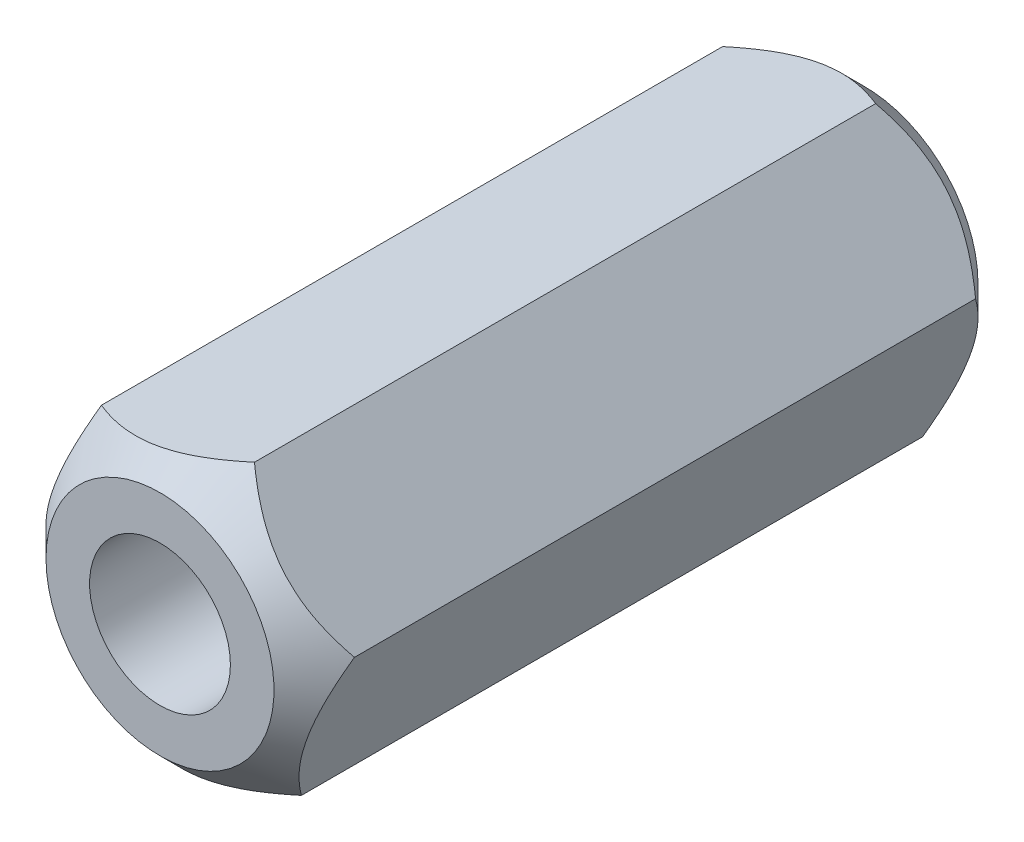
ISO-10303-21;
HEADER;
FILE_DESCRIPTION(('STEP AP214'),'2;1');
FILE_NAME('part.step','',(''),(''),'','','');
FILE_SCHEMA(('AUTOMOTIVE_DESIGN { 1 0 10303 214 1 1 1 1 }'));
ENDSEC;
DATA;
#1=APPLICATION_CONTEXT('core data for automotive mechanical design processes');
#2=APPLICATION_PROTOCOL_DEFINITION('international standard','automotive_design',2000,#1);
#3=PRODUCT_CONTEXT('',#1,'mechanical');
#4=PRODUCT('Part','Part','',(#3));
#5=PRODUCT_RELATED_PRODUCT_CATEGORY('part','',(#4));
#6=PRODUCT_DEFINITION_FORMATION('','',#4);
#7=PRODUCT_DEFINITION_CONTEXT('part definition',#1,'design');
#8=PRODUCT_DEFINITION('design','',#6,#7);
#9=PRODUCT_DEFINITION_SHAPE('','',#8);
#10=(LENGTH_UNIT() NAMED_UNIT(*) SI_UNIT(.MILLI.,.METRE.));
#11=(NAMED_UNIT(*) PLANE_ANGLE_UNIT() SI_UNIT($,.RADIAN.));
#12=(NAMED_UNIT(*) SI_UNIT($,.STERADIAN.) SOLID_ANGLE_UNIT());
#13=UNCERTAINTY_MEASURE_WITH_UNIT(LENGTH_MEASURE(1.E-05),#10,'distance_accuracy_value','');
#14=(GEOMETRIC_REPRESENTATION_CONTEXT(3) GLOBAL_UNCERTAINTY_ASSIGNED_CONTEXT((#13)) GLOBAL_UNIT_ASSIGNED_CONTEXT((#10,
#11,#12)) REPRESENTATION_CONTEXT('',''));
#15=CARTESIAN_POINT('',(0.,0.,0.));
#16=DIRECTION('',(0.,0.,1.));
#17=DIRECTION('',(1.,0.,0.));
#18=AXIS2_PLACEMENT_3D('',#15,#16,#17);
#19=CARTESIAN_POINT('',(23.598367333,209.806088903,-17.));
#20=DIRECTION('',(0.,0.,-1.));
#21=DIRECTION('',(-0.984657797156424,-0.174496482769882,0.));
#22=AXIS2_PLACEMENT_3D('',#19,#20,#21);
#23=PLANE('',#22);
#24=CARTESIAN_POINT('',(17.14,214.32,-16.9999999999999));
#25=DIRECTION('',(0.,0.,1.));
#26=DIRECTION('',(1.,0.,0.));
#27=AXIS2_PLACEMENT_3D('',#24,#25,#26);
#28=CIRCLE('',#27,5.50555349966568);
#29=CARTESIAN_POINT('',(22.6455534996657,214.32,-16.9999999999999));
#30=VERTEX_POINT('',#29);
#31=EDGE_CURVE('E45',#30,#30,#28,.F.);
#32=ORIENTED_EDGE('',*,*,#31,.T.);
#33=EDGE_LOOP('',(#32));
#34=FACE_BOUND('',#33,.T.);
#35=CARTESIAN_POINT('',(17.14,214.32,-16.9999999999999));
#36=DIRECTION('',(0.,0.,1.));
#37=DIRECTION('',(1.,0.,0.));
#38=AXIS2_PLACEMENT_3D('',#35,#36,#37);
#39=CIRCLE('',#38,3.39999999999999);
#40=CARTESIAN_POINT('',(20.54,214.32,-16.9999999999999));
#41=VERTEX_POINT('',#40);
#42=EDGE_CURVE('E251',#41,#41,#39,.T.);
#43=ORIENTED_EDGE('',*,*,#42,.T.);
#44=EDGE_LOOP('',(#43));
#45=FACE_BOUND('',#44,.T.);
#46=ADVANCED_FACE('F41',(#34,#45),#23,.T.);
#47=CARTESIAN_POINT('',(17.14,214.32,-17.));
#48=DIRECTION('',(0.,0.,1.));
#49=DIRECTION('',(1.,0.,0.));
#50=AXIS2_PLACEMENT_3D('',#47,#48,#49);
#51=CONICAL_SURFACE('',#50,5.50555349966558,0.785398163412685);
#52=CARTESIAN_POINT('',(19.7009737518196,221.375122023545,-15.0000000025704));
#53=CARTESIAN_POINT('',(19.7840077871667,221.276338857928,-15.0645131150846));
#54=CARTESIAN_POINT('',(19.8676800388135,221.176796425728,-15.1270462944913));
#55=CARTESIAN_POINT('',(20.0364261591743,220.976044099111,-15.2475505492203));
#56=CARTESIAN_POINT('',(20.1215007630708,220.87483333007,-15.3055191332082));
#57=CARTESIAN_POINT('',(20.3798060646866,220.567535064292,-15.4721688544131));
#58=CARTESIAN_POINT('',(20.5552232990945,220.358846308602,-15.5728831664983));
#59=CARTESIAN_POINT('',(20.9089660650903,219.938008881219,-15.7453489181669));
#60=CARTESIAN_POINT('',(21.0872012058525,219.725967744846,-15.8175348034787));
#61=CARTESIAN_POINT('',(21.3574838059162,219.404420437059,-15.9010357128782));
#62=CARTESIAN_POINT('',(21.4479758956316,219.296764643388,-15.9247285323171));
#63=CARTESIAN_POINT('',(21.6297261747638,219.080541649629,-15.9633187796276));
#64=CARTESIAN_POINT('',(21.7209842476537,218.971974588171,-15.9782175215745));
#65=CARTESIAN_POINT('',(21.943375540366,218.707402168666,-16.0031980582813));
#66=CARTESIAN_POINT('',(22.0747483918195,218.551111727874,-16.008438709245));
#67=CARTESIAN_POINT('',(22.3372572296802,218.23881263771,-15.9996376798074));
#68=CARTESIAN_POINT('',(22.4683931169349,218.082804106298,-15.9855892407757));
#69=CARTESIAN_POINT('',(22.729428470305,217.772257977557,-15.9390381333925));
#70=CARTESIAN_POINT('',(22.85932638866,217.617722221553,-15.9065148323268));
#71=CARTESIAN_POINT('',(23.116889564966,217.311306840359,-15.8247821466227));
#72=CARTESIAN_POINT('',(23.2445549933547,217.159427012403,-15.7755740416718));
#73=CARTESIAN_POINT('',(23.4711684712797,216.889831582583,-15.6743452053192));
#74=CARTESIAN_POINT('',(23.5706186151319,216.771518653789,-15.6249882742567));
#75=CARTESIAN_POINT('',(23.7677339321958,216.537016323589,-15.5183218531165));
#76=CARTESIAN_POINT('',(23.8653990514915,216.420826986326,-15.4610121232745));
#77=CARTESIAN_POINT('',(24.0586366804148,216.190937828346,-15.339724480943));
#78=CARTESIAN_POINT('',(24.1542146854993,216.077231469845,-15.275767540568));
#79=CARTESIAN_POINT('',(24.3436011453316,215.851923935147,-15.1420248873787));
#80=CARTESIAN_POINT('',(24.4374106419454,215.740321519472,-15.0722427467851));
#81=CARTESIAN_POINT('',(24.5304017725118,215.62969268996,-15.0000000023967));
#82=B_SPLINE_CURVE_WITH_KNOTS('',3,(#52,#53,#54,#55,#56,#57,#58,#59,#60,#61,#62,#63,#64,#65,#66,
#67,#68,#69,#70,#71,#72,#73,#74,#75,#76,#77,#78,#79,#80,#81),.UNSPECIFIED.,.F.,.F.,(4,2,2,2,2,2,
2,2,2,2,2,2,2,2,4),(0.,0.432793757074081,0.86582211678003,1.73655298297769,2.59345958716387,
3.02107268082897,3.44862186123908,4.0603826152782,4.67235777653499,5.28501773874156,
5.89763072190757,6.38414619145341,6.87067633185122,7.35571555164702,7.84045948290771),.UNSPECIFIED.);
#83=CARTESIAN_POINT('',(19.7009737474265,221.375122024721,-15.0000000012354));
#84=VERTEX_POINT('',#83);
#85=CARTESIAN_POINT('',(24.5304017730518,215.629692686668,-15.0000000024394));
#86=VERTEX_POINT('',#85);
#87=EDGE_CURVE('E88',#84,#86,#82,.T.);
#88=ORIENTED_EDGE('',*,*,#87,.T.);
#89=CARTESIAN_POINT('',(24.5304017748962,215.629692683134,-15.0000000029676));
#90=CARTESIAN_POINT('',(24.4863700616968,215.508391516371,-15.0645131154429));
#91=CARTESIAN_POINT('',(24.4419999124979,215.386158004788,-15.1270462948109));
#92=CARTESIAN_POINT('',(24.3525163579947,215.139643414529,-15.2475505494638));
#93=CARTESIAN_POINT('',(24.3074025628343,215.015361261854,-15.3055191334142));
#94=CARTESIAN_POINT('',(24.1704271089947,214.638013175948,-15.4721688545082));
#95=CARTESIAN_POINT('',(24.0774059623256,214.381753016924,-15.5728831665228));
#96=CARTESIAN_POINT('',(23.8898214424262,213.864984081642,-15.7453489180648));
#97=CARTESIAN_POINT('',(23.7953060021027,213.604607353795,-15.8175348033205));
#98=CARTESIAN_POINT('',(23.6519791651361,213.209762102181,-15.9010357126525));
#99=CARTESIAN_POINT('',(23.6039925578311,213.077565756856,-15.9247285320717));
#100=CARTESIAN_POINT('',(23.5076130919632,212.812053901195,-15.9633187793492));
#101=CARTESIAN_POINT('',(23.4592202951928,212.67873856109,-15.9782175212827));
#102=CARTESIAN_POINT('',(23.341289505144,212.353855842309,-16.0031980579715));
#103=CARTESIAN_POINT('',(23.2716244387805,212.16193839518,-16.0084387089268));
#104=CARTESIAN_POINT('',(23.1324199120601,211.77844952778,-15.9996376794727));
#105=CARTESIAN_POINT('',(23.0628805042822,211.586878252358,-15.9855892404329));
#106=CARTESIAN_POINT('',(22.9244573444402,211.20554194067,-15.9390381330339));
#107=CARTESIAN_POINT('',(22.8555744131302,211.015779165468,-15.9065148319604));
#108=CARTESIAN_POINT('',(22.7189924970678,210.639515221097,-15.8247821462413));
#109=CARTESIAN_POINT('',(22.6512934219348,210.453013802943,-15.7755740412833));
#110=CARTESIAN_POINT('',(22.5311236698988,210.121963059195,-15.6743452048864));
#111=CARTESIAN_POINT('',(22.4783867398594,209.976680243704,-15.6249882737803));
#112=CARTESIAN_POINT('',(22.3738594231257,209.68872220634,-15.5183218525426));
#113=CARTESIAN_POINT('',(22.3220690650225,209.546047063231,-15.4610121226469));
#114=CARTESIAN_POINT('',(22.2195980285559,209.263753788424,-15.3397244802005));
#115=CARTESIAN_POINT('',(22.1689144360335,209.124127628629,-15.2757675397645));
#116=CARTESIAN_POINT('',(22.0684856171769,208.847460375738,-15.1420248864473));
#117=CARTESIAN_POINT('',(22.0187398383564,208.710417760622,-15.0722427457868));
#118=CARTESIAN_POINT('',(21.9694280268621,208.574570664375,-15.0000000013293));
#119=B_SPLINE_CURVE_WITH_KNOTS('',3,(#89,#90,#91,#92,#93,#94,#95,#96,#97,#98,#99,#100,#101,#102,
#103,#104,#105,#106,#107,#108,#109,#110,#111,#112,#113,#114,#115,#116,#117,#118),.UNSPECIFIED.,
.F.,.F.,(4,2,2,2,2,2,2,2,2,2,2,2,2,2,4),(0.,0.432793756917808,0.865822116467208,
1.73655298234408,2.59345958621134,3.02107267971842,3.44862185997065,4.06038261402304,
4.67235777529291,5.28501773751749,5.89763072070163,6.38414619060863,6.87067633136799,
7.35571555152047,7.84045948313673),.UNSPECIFIED.);
#120=CARTESIAN_POINT('',(21.9694280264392,208.57457066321,-15.0000000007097));
#121=VERTEX_POINT('',#120);
#122=EDGE_CURVE('E91',#86,#121,#119,.T.);
#123=ORIENTED_EDGE('',*,*,#122,.T.);
#124=CARTESIAN_POINT('',(21.9694280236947,208.574570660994,-15.0000000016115));
#125=CARTESIAN_POINT('',(21.8423622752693,208.552052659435,-15.064513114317));
#126=CARTESIAN_POINT('',(21.7143198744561,208.529361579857,-15.1270462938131));
#127=CARTESIAN_POINT('',(21.4560901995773,208.483599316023,-15.2475505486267));
#128=CARTESIAN_POINT('',(21.3259018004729,208.460527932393,-15.3055191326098));
#129=CARTESIAN_POINT('',(20.9306210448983,208.390478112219,-15.4721688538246));
#130=CARTESIAN_POINT('',(20.6621826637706,208.342906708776,-15.5728831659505));
#131=CARTESIAN_POINT('',(20.1208553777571,208.246975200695,-15.7453489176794));
#132=CARTESIAN_POINT('',(19.8481047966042,208.198639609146,-15.8175348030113));
#133=CARTESIAN_POINT('',(19.4344953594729,208.125341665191,-15.9010357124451));
#134=CARTESIAN_POINT('',(19.2960166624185,208.100801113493,-15.924728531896));
#135=CARTESIAN_POINT('',(19.0178869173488,208.051512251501,-15.9633187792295));
#136=CARTESIAN_POINT('',(18.8782360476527,208.026763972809,-15.9782175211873));
#137=CARTESIAN_POINT('',(18.5379139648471,207.966453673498,-16.0031980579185));
#138=CARTESIAN_POINT('',(18.336876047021,207.930826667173,-16.0084387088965));
#139=CARTESIAN_POINT('',(17.9351626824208,207.859636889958,-15.9996376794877));
#140=CARTESIAN_POINT('',(17.7344873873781,207.824074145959,-15.9855892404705));
#141=CARTESIAN_POINT('',(17.3350288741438,207.753283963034,-15.9390381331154));
#142=CARTESIAN_POINT('',(17.1362480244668,207.718056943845,-15.9065148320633));
#143=CARTESIAN_POINT('',(16.7421029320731,207.64820838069,-15.8247821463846));
#144=CARTESIAN_POINT('',(16.5467384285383,207.613586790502,-15.7755740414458));
#145=CARTESIAN_POINT('',(16.1999551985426,207.552131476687,-15.6743452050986));
#146=CARTESIAN_POINT('',(16.0477681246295,207.525161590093,-15.6249882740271));
#147=CARTESIAN_POINT('',(15.7461254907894,207.471705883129,-15.518321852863));
#148=CARTESIAN_POINT('',(15.5966700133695,207.445220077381,-15.4610121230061));
#149=CARTESIAN_POINT('',(15.3009613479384,207.392815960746,-15.3397244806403));
#150=CARTESIAN_POINT('',(15.1546997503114,207.366896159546,-15.275767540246));
#151=CARTESIAN_POINT('',(14.8648844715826,207.315536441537,-15.1420248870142));
#152=CARTESIAN_POINT('',(14.7213291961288,207.290096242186,-15.0722427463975));
#153=CARTESIAN_POINT('',(14.5790262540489,207.26487797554,-15.0000000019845));
#154=B_SPLINE_CURVE_WITH_KNOTS('',3,(#124,#125,#126,#127,#128,#129,#130,#131,#132,#133,#134,
#135,#136,#137,#138,#139,#140,#141,#142,#143,#144,#145,#146,#147,#148,#149,#150,#151,#152,#153),
.UNSPECIFIED.,.F.,.F.,(4,2,2,2,2,2,2,2,2,2,2,2,2,2,4),(0.,0.432793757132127,0.865822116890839,
1.73655298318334,2.59345958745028,3.02107268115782,3.4486218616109,4.06038261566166,
4.67235777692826,5.28501773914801,5.89763072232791,6.38414619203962,6.87067633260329,
7.35571555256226,7.84045948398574),.UNSPECIFIED.);
#155=CARTESIAN_POINT('',(14.5790262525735,207.264877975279,-15.0000000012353));
#156=VERTEX_POINT('',#155);
#157=EDGE_CURVE('E176',#121,#156,#154,.T.);
#158=ORIENTED_EDGE('',*,*,#157,.T.);
#159=CARTESIAN_POINT('',(14.5790262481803,207.264877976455,-15.0000000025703));
#160=CARTESIAN_POINT('',(14.4959922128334,207.363661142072,-15.0645131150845));
#161=CARTESIAN_POINT('',(14.4123199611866,207.463203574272,-15.1270462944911));
#162=CARTESIAN_POINT('',(14.2435738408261,207.663955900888,-15.2475505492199));
#163=CARTESIAN_POINT('',(14.1584992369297,207.76516666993,-15.3055191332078));
#164=CARTESIAN_POINT('',(13.9001939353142,208.072464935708,-15.4721688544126));
#165=CARTESIAN_POINT('',(13.7247767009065,208.281153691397,-15.5728831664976));
#166=CARTESIAN_POINT('',(13.3710339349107,208.70199111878,-15.7453489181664));
#167=CARTESIAN_POINT('',(13.1927987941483,208.914032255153,-15.8175348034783));
#168=CARTESIAN_POINT('',(12.9225161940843,209.23557956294,-15.9010357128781));
#169=CARTESIAN_POINT('',(12.8320241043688,209.343235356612,-15.924728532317));
#170=CARTESIAN_POINT('',(12.6502738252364,209.559458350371,-15.9633187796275));
#171=CARTESIAN_POINT('',(12.5590157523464,209.668025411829,-15.9782175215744));
#172=CARTESIAN_POINT('',(12.3366244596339,209.932597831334,-16.0031980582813));
#173=CARTESIAN_POINT('',(12.2052516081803,210.088888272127,-16.0084387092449));
#174=CARTESIAN_POINT('',(11.9427427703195,210.40118736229,-15.9996376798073));
#175=CARTESIAN_POINT('',(11.8116068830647,210.557195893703,-15.9855892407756));
#176=CARTESIAN_POINT('',(11.5505715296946,210.867742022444,-15.9390381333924));
#177=CARTESIAN_POINT('',(11.4206736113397,211.022277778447,-15.9065148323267));
#178=CARTESIAN_POINT('',(11.1631104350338,211.328693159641,-15.8247821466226));
#179=CARTESIAN_POINT('',(11.0354450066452,211.480572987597,-15.7755740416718));
#180=CARTESIAN_POINT('',(10.8088315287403,211.750168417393,-15.674345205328));
#181=CARTESIAN_POINT('',(10.7093813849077,211.868481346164,-15.6249882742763));
#182=CARTESIAN_POINT('',(10.5122660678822,212.102983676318,-15.5183218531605));
#183=CARTESIAN_POINT('',(10.4146009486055,212.219173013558,-15.4610121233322));
#184=CARTESIAN_POINT('',(10.2213633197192,212.449062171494,-15.3397244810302));
#185=CARTESIAN_POINT('',(10.1257853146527,212.562768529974,-15.2757675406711));
#186=CARTESIAN_POINT('',(9.93639885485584,212.78807606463,-15.1420248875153));
#187=CARTESIAN_POINT('',(9.84258935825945,212.899678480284,-15.0722427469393));
#188=CARTESIAN_POINT('',(9.74959822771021,213.010307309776,-15.0000000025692));
#189=B_SPLINE_CURVE_WITH_KNOTS('',3,(#159,#160,#161,#162,#163,#164,#165,#166,#167,#168,#169,
#170,#171,#172,#173,#174,#175,#176,#177,#178,#179,#180,#181,#182,#183,#184,#185,#186,#187,#188),
.UNSPECIFIED.,.F.,.F.,(4,2,2,2,2,2,2,2,2,2,2,2,2,2,4),(0.,0.432793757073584,0.86582211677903,
1.73655298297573,2.59345958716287,3.02107268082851,3.44862186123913,4.06038261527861,
4.67235777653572,5.28501773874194,5.89763072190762,6.3841461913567,6.87067633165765,
7.35571555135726,7.84045948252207),.UNSPECIFIED.);
#190=CARTESIAN_POINT('',(9.74959822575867,213.010307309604,-15.0000000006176));
#191=VERTEX_POINT('',#190);
#192=EDGE_CURVE('E183',#156,#191,#189,.T.);
#193=ORIENTED_EDGE('',*,*,#192,.T.);
#194=CARTESIAN_POINT('',(9.74959822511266,213.010307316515,-15.0000000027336));
#195=CARTESIAN_POINT('',(9.79362993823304,213.131608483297,-15.0645131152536));
#196=CARTESIAN_POINT('',(9.83800008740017,213.253841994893,-15.1270462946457));
#197=CARTESIAN_POINT('',(9.92748364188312,213.500356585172,-15.2475505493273));
#198=CARTESIAN_POINT('',(9.97259743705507,213.624638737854,-15.3055191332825));
#199=CARTESIAN_POINT('',(10.1095728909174,214.001986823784,-15.4721688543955));
#200=CARTESIAN_POINT('',(10.2025940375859,214.258246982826,-15.5728831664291));
#201=CARTESIAN_POINT('',(10.390178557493,214.775015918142,-15.7453489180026));
#202=CARTESIAN_POINT('',(10.4846939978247,215.035392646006,-15.8175348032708));
#203=CARTESIAN_POINT('',(10.6280208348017,215.430237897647,-15.90103571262));
#204=CARTESIAN_POINT('',(10.6760074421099,215.562434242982,-15.9247285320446));
#205=CARTESIAN_POINT('',(10.7723869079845,215.827946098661,-15.9633187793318));
#206=CARTESIAN_POINT('',(10.8207797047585,215.961261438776,-15.9782175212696));
#207=CARTESIAN_POINT('',(10.9387104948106,216.286144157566,-16.003198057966));
#208=CARTESIAN_POINT('',(11.0083755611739,216.478061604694,-16.0084387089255));
#209=CARTESIAN_POINT('',(11.1475800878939,216.861550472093,-15.9996376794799));
#210=CARTESIAN_POINT('',(11.2171194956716,217.053121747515,-15.9855892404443));
#211=CARTESIAN_POINT('',(11.3555426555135,217.434458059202,-15.9390381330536));
#212=CARTESIAN_POINT('',(11.4244255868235,217.624220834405,-15.9065148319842));
#213=CARTESIAN_POINT('',(11.5610075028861,218.000484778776,-15.8247821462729));
#214=CARTESIAN_POINT('',(11.6287065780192,218.18698619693,-15.7755740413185));
#215=CARTESIAN_POINT('',(11.7488763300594,218.51803694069,-15.6743452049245));
#216=CARTESIAN_POINT('',(11.8016132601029,218.663319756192,-15.6249882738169));
#217=CARTESIAN_POINT('',(11.9061405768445,218.951277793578,-15.518321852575));
#218=CARTESIAN_POINT('',(11.9579309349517,219.093952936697,-15.4610121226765));
#219=CARTESIAN_POINT('',(12.0604019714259,219.376246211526,-15.3397244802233));
#220=CARTESIAN_POINT('',(12.111085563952,219.515872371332,-15.2757675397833));
#221=CARTESIAN_POINT('',(12.211514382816,219.792539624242,-15.1420248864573));
#222=CARTESIAN_POINT('',(12.2612601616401,219.929582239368,-15.0722427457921));
#223=CARTESIAN_POINT('',(12.3105719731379,220.065429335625,-15.0000000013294));
#224=B_SPLINE_CURVE_WITH_KNOTS('',3,(#194,#195,#196,#197,#198,#199,#200,#201,#202,#203,#204,
#205,#206,#207,#208,#209,#210,#211,#212,#213,#214,#215,#216,#217,#218,#219,#220,#221,#222,#223),
.UNSPECIFIED.,.F.,.F.,(4,2,2,2,2,2,2,2,2,2,2,2,2,2,4),(0.,0.432793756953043,0.865822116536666,
1.73655298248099,2.59345958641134,3.02107267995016,3.44862186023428,4.06038261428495,
4.67235777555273,5.28501773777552,5.89763072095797,6.38414619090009,6.87067633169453,
7.35571555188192,7.84045948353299),.UNSPECIFIED.);
#225=CARTESIAN_POINT('',(12.3105719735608,220.06542933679,-15.0000000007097));
#226=VERTEX_POINT('',#225);
#227=EDGE_CURVE('E193',#191,#226,#224,.T.);
#228=ORIENTED_EDGE('',*,*,#227,.T.);
#229=CARTESIAN_POINT('',(12.3105719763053,220.065429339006,-15.0000000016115));
#230=CARTESIAN_POINT('',(12.4376377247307,220.087947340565,-15.0645131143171));
#231=CARTESIAN_POINT('',(12.5656801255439,220.110638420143,-15.1270462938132));
#232=CARTESIAN_POINT('',(12.8239098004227,220.156400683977,-15.2475505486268));
#233=CARTESIAN_POINT('',(12.954098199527,220.179472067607,-15.3055191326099));
#234=CARTESIAN_POINT('',(13.3493789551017,220.249521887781,-15.4721688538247));
#235=CARTESIAN_POINT('',(13.6178173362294,220.297093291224,-15.5728831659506));
#236=CARTESIAN_POINT('',(14.1591446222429,220.393024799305,-15.7453489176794));
#237=CARTESIAN_POINT('',(14.4318952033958,220.441360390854,-15.8175348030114));
#238=CARTESIAN_POINT('',(14.8455046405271,220.514658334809,-15.9010357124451));
#239=CARTESIAN_POINT('',(14.9839833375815,220.539198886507,-15.9247285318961));
#240=CARTESIAN_POINT('',(15.2621130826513,220.588487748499,-15.9633187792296));
#241=CARTESIAN_POINT('',(15.4017639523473,220.613236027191,-15.9782175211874));
#242=CARTESIAN_POINT('',(15.742086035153,220.673546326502,-16.0031980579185));
#243=CARTESIAN_POINT('',(15.943123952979,220.709173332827,-16.0084387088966));
#244=CARTESIAN_POINT('',(16.3448373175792,220.780363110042,-15.9996376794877));
#245=CARTESIAN_POINT('',(16.5455126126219,220.815925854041,-15.9855892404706));
#246=CARTESIAN_POINT('',(16.9449711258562,220.886716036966,-15.9390381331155));
#247=CARTESIAN_POINT('',(17.1437519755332,220.921943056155,-15.9065148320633));
#248=CARTESIAN_POINT('',(17.5378970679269,220.99179161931,-15.8247821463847));
#249=CARTESIAN_POINT('',(17.7332615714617,221.026413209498,-15.7755740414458));
#250=CARTESIAN_POINT('',(18.0800448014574,221.087868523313,-15.6743452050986));
#251=CARTESIAN_POINT('',(18.2322318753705,221.114838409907,-15.6249882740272));
#252=CARTESIAN_POINT('',(18.5338745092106,221.168294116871,-15.518321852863));
#253=CARTESIAN_POINT('',(18.6833299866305,221.194779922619,-15.4610121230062));
#254=CARTESIAN_POINT('',(18.9790386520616,221.247184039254,-15.3397244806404));
#255=CARTESIAN_POINT('',(19.1253002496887,221.273103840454,-15.275767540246));
#256=CARTESIAN_POINT('',(19.4151155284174,221.324463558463,-15.1420248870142));
#257=CARTESIAN_POINT('',(19.5586708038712,221.349903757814,-15.0722427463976));
#258=CARTESIAN_POINT('',(19.7009737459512,221.37512202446,-15.0000000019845));
#259=B_SPLINE_CURVE_WITH_KNOTS('',3,(#229,#230,#231,#232,#233,#234,#235,#236,#237,#238,#239,
#240,#241,#242,#243,#244,#245,#246,#247,#248,#249,#250,#251,#252,#253,#254,#255,#256,#257,#258),
.UNSPECIFIED.,.F.,.F.,(4,2,2,2,2,2,2,2,2,2,2,2,2,2,4),(0.,0.432793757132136,0.86582211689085,
1.73655298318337,2.59345958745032,3.02107268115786,3.44862186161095,4.0603826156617,
4.67235777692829,5.28501773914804,5.89763072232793,6.38414619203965,6.87067633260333,
7.35571555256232,7.84045948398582),.UNSPECIFIED.);
#260=EDGE_CURVE('E94',#226,#84,#259,.T.);
#261=ORIENTED_EDGE('',*,*,#260,.T.);
#262=EDGE_LOOP('',(#88,#123,#158,#193,#228,#261));
#263=FACE_BOUND('',#262,.T.);
#264=ORIENTED_EDGE('',*,*,#31,.F.);
#265=EDGE_LOOP('',(#264));
#266=FACE_BOUND('',#265,.T.);
#267=ADVANCED_FACE('F89',(#263,#266),#51,.T.);
#268=CARTESIAN_POINT('',(24.530401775,215.629692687,-16.239643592));
#269=DIRECTION('',(-0.939986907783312,0.341210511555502,0.));
#270=DIRECTION('',(-0.341210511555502,-0.939986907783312,0.));
#271=AXIS2_PLACEMENT_3D('',#268,#269,#270);
#272=PLANE('',#271);
#273=DIRECTION('',(0.,0.,-1.));
#274=VECTOR('',#273,1.);
#275=CARTESIAN_POINT('',(21.969428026,208.574570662,0.));
#276=LINE('',#275,#274);
#277=CARTESIAN_POINT('',(21.9694280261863,208.574570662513,15.000000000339));
#278=VERTEX_POINT('',#277);
#279=EDGE_CURVE('E103',#278,#121,#276,.T.);
#280=ORIENTED_EDGE('',*,*,#279,.T.);
#281=ORIENTED_EDGE('',*,*,#122,.F.);
#282=DIRECTION('',(0.,0.,1.));
#283=VECTOR('',#282,1.);
#284=CARTESIAN_POINT('',(24.530401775,215.629692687,0.));
#285=LINE('',#284,#283);
#286=CARTESIAN_POINT('',(24.5304017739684,215.629692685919,15.0000000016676));
#287=VERTEX_POINT('',#286);
#288=EDGE_CURVE('E61',#86,#287,#285,.T.);
#289=ORIENTED_EDGE('',*,*,#288,.T.);
#290=CARTESIAN_POINT('',(24.5304017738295,215.629692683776,15.0000000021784));
#291=CARTESIAN_POINT('',(24.4863700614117,215.508391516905,15.0645131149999));
#292=CARTESIAN_POINT('',(24.4419999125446,215.386158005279,15.1270462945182));
#293=CARTESIAN_POINT('',(24.352516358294,215.139643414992,15.2475505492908));
#294=CARTESIAN_POINT('',(24.3074025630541,215.015361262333,15.3055191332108));
#295=CARTESIAN_POINT('',(24.1704271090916,214.638013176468,15.4721688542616));
#296=CARTESIAN_POINT('',(24.077405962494,214.381753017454,15.5728831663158));
#297=CARTESIAN_POINT('',(23.8898214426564,213.864984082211,15.7453489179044));
#298=CARTESIAN_POINT('',(23.7953060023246,213.604607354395,15.8175348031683));
#299=CARTESIAN_POINT('',(23.6519791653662,213.209762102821,15.9010357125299));
#300=CARTESIAN_POINT('',(23.603992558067,213.077565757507,15.9247285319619));
#301=CARTESIAN_POINT('',(23.5076130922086,212.81205390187,15.9633187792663));
#302=CARTESIAN_POINT('',(23.4592202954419,212.678738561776,15.978217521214));
#303=CARTESIAN_POINT('',(23.3412895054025,212.353855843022,16.0031980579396));
#304=CARTESIAN_POINT('',(23.2716244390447,212.161938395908,16.0084387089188));
#305=CARTESIAN_POINT('',(23.1324199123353,211.778449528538,15.9996376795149));
#306=CARTESIAN_POINT('',(23.0628805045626,211.58687825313,15.9855892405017));
#307=CARTESIAN_POINT('',(22.9244573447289,211.205541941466,15.9390381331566));
#308=CARTESIAN_POINT('',(22.8555744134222,211.015779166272,15.9065148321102));
#309=CARTESIAN_POINT('',(22.7189924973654,210.639515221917,15.8247821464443));
#310=CARTESIAN_POINT('',(22.6512934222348,210.45301380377,15.7755740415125));
#311=CARTESIAN_POINT('',(22.5311236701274,210.121963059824,15.6743452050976));
#312=CARTESIAN_POINT('',(22.4783867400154,209.976680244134,15.6249882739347));
#313=CARTESIAN_POINT('',(22.3738594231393,209.688722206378,15.5183218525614));
#314=CARTESIAN_POINT('',(22.3220690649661,209.546047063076,15.4610121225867));
#315=CARTESIAN_POINT('',(22.2195980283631,209.263753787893,15.3397244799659));
#316=CARTESIAN_POINT('',(22.1689144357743,209.124127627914,15.2757675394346));
#317=CARTESIAN_POINT('',(22.0684856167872,208.847460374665,15.1420248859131));
#318=CARTESIAN_POINT('',(22.0187398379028,208.710417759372,15.0722427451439));
#319=CARTESIAN_POINT('',(21.9694280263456,208.574570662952,15.0000000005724));
#320=B_SPLINE_CURVE_WITH_KNOTS('',3,(#290,#291,#292,#293,#294,#295,#296,#297,#298,#299,#300,
#301,#302,#303,#304,#305,#306,#307,#308,#309,#310,#311,#312,#313,#314,#315,#316,#317,#318,#319),
.UNSPECIFIED.,.F.,.F.,(4,2,2,2,2,2,2,2,2,2,2,2,2,2,4),(0.,0.432793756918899,0.865822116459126,
1.73655298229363,2.59345958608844,3.0210726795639,3.44862185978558,4.06038261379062,
4.67235777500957,5.2850177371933,5.89763072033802,6.38414619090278,6.87067633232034,
7.35571555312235,7.84045948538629),.UNSPECIFIED.);
#321=EDGE_CURVE('E110',#287,#278,#320,.T.);
#322=ORIENTED_EDGE('',*,*,#321,.T.);
#323=EDGE_LOOP('',(#280,#281,#289,#322));
#324=FACE_BOUND('',#323,.T.);
#325=ADVANCED_FACE('F101',(#324),#272,.F.);
#326=CARTESIAN_POINT('',(14.579026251,207.264877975,-16.202362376));
#327=DIRECTION('',(-0.174496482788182,0.98465779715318,0.));
#328=DIRECTION('',(0.,0.,1.));
#329=AXIS2_PLACEMENT_3D('',#326,#327,#328);
#330=PLANE('',#329);
#331=DIRECTION('',(0.,0.,-1.));
#332=VECTOR('',#331,1.);
#333=CARTESIAN_POINT('',(14.579026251,207.264877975,0.));
#334=LINE('',#333,#332);
#335=CARTESIAN_POINT('',(14.5790262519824,207.264877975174,15.0000000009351));
#336=VERTEX_POINT('',#335);
#337=EDGE_CURVE('E182',#336,#156,#334,.T.);
#338=ORIENTED_EDGE('',*,*,#337,.T.);
#339=ORIENTED_EDGE('',*,*,#157,.F.);
#340=ORIENTED_EDGE('',*,*,#279,.F.);
#341=CARTESIAN_POINT('',(21.9694280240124,208.574570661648,15.0000000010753));
#342=CARTESIAN_POINT('',(21.8423622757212,208.552052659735,15.0645131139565));
#343=CARTESIAN_POINT('',(21.7143198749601,208.529361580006,15.1270462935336));
#344=CARTESIAN_POINT('',(21.4560902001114,208.483599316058,15.2475505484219));
#345=CARTESIAN_POINT('',(21.3259018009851,208.460527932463,15.3055191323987));
#346=CARTESIAN_POINT('',(20.9306210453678,208.390478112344,15.4721688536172));
#347=CARTESIAN_POINT('',(20.6621826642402,208.342906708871,15.5728831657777));
#348=CARTESIAN_POINT('',(20.1208553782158,208.246975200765,15.7453489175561));
#349=CARTESIAN_POINT('',(19.8481047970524,208.198639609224,15.8175348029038));
#350=CARTESIAN_POINT('',(19.434495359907,208.125341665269,15.901035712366));
#351=CARTESIAN_POINT('',(19.2960166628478,208.100801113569,15.9247285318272));
#352=CARTESIAN_POINT('',(19.0178869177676,208.051512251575,15.9633187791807));
#353=CARTESIAN_POINT('',(18.8782360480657,208.026763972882,15.9782175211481));
#354=CARTESIAN_POINT('',(18.5379139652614,207.966453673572,16.0031980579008));
#355=CARTESIAN_POINT('',(18.3368760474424,207.930826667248,16.0084387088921));
#356=CARTESIAN_POINT('',(17.9351626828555,207.859636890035,15.9996376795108));
#357=CARTESIAN_POINT('',(17.734487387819,207.824074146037,15.985589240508));
#358=CARTESIAN_POINT('',(17.3350288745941,207.753283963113,15.9390381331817));
#359=CARTESIAN_POINT('',(17.1362480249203,207.718056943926,15.9065148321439));
#360=CARTESIAN_POINT('',(16.7421029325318,207.648208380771,15.8247821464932));
#361=CARTESIAN_POINT('',(16.546738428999,207.613586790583,15.7755740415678));
#362=CARTESIAN_POINT('',(16.1999551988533,207.552131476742,15.6743452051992));
#363=CARTESIAN_POINT('',(16.047768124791,207.525161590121,15.6249882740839));
#364=CARTESIAN_POINT('',(15.7461254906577,207.471705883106,15.5183218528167));
#365=CARTESIAN_POINT('',(15.5966700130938,207.445220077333,15.4610121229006));
#366=CARTESIAN_POINT('',(15.3009613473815,207.392815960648,15.3397244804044));
#367=CARTESIAN_POINT('',(15.1546997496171,207.366896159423,15.2757675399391));
#368=CARTESIAN_POINT('',(14.864884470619,207.315536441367,15.142024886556));
#369=CARTESIAN_POINT('',(14.7213291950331,207.290096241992,15.072242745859));
#370=CARTESIAN_POINT('',(14.5790262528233,207.264877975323,15.0000000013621));
#371=B_SPLINE_CURVE_WITH_KNOTS('',3,(#341,#342,#343,#344,#345,#346,#347,#348,#349,#350,#351,
#352,#353,#354,#355,#356,#357,#358,#359,#360,#361,#362,#363,#364,#365,#366,#367,#368,#369,#370),
.UNSPECIFIED.,.F.,.F.,(4,2,2,2,2,2,2,2,2,2,2,2,2,2,4),(0.,0.432793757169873,0.865822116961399,
1.73655298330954,2.59345958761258,3.02107268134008,3.44862186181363,4.06038261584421,
4.6723577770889,5.28501773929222,5.8976307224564,6.38414619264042,6.87067633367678,
7.35571555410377,7.84045948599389),.UNSPECIFIED.);
#372=EDGE_CURVE('E115',#278,#336,#371,.T.);
#373=ORIENTED_EDGE('',*,*,#372,.T.);
#374=EDGE_LOOP('',(#338,#339,#340,#373));
#375=FACE_BOUND('',#374,.T.);
#376=ADVANCED_FACE('F166',(#375),#330,.F.);
#377=CARTESIAN_POINT('',(14.579026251,207.264877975,-16.239643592));
#378=DIRECTION('',(0.76549042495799,0.643447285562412,0.));
#379=DIRECTION('',(-0.643447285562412,0.76549042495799,0.));
#380=AXIS2_PLACEMENT_3D('',#377,#378,#379);
#381=PLANE('',#380);
#382=DIRECTION('',(0.,0.,-1.));
#383=VECTOR('',#382,1.);
#384=CARTESIAN_POINT('',(9.749598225,213.010307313,0.));
#385=LINE('',#384,#383);
#386=CARTESIAN_POINT('',(9.74959822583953,213.010307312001,15.0000000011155));
#387=VERTEX_POINT('',#386);
#388=EDGE_CURVE('E192',#387,#191,#385,.T.);
#389=ORIENTED_EDGE('',*,*,#388,.T.);
#390=ORIENTED_EDGE('',*,*,#192,.F.);
#391=ORIENTED_EDGE('',*,*,#337,.F.);
#392=CARTESIAN_POINT('',(14.5790262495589,207.264877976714,15.0000000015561));
#393=CARTESIAN_POINT('',(14.4959922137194,207.363661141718,15.0645131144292));
#394=CARTESIAN_POINT('',(14.4123199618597,207.463203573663,15.1270462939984));
#395=CARTESIAN_POINT('',(14.2435738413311,207.663955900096,15.2475505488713));
#396=CARTESIAN_POINT('',(14.1584992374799,207.765166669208,15.3055191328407));
#397=CARTESIAN_POINT('',(13.9001939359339,208.072464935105,15.4721688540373));
#398=CARTESIAN_POINT('',(13.724776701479,208.281153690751,15.5728831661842));
#399=CARTESIAN_POINT('',(13.3710339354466,208.701991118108,15.7453489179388));
#400=CARTESIAN_POINT('',(13.1927987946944,208.914032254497,15.8175348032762));
#401=CARTESIAN_POINT('',(12.9225161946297,209.235579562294,15.9010357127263));
#402=CARTESIAN_POINT('',(12.8320241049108,209.343235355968,15.924728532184));
#403=CARTESIAN_POINT('',(12.6502738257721,209.559458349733,15.9633187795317));
#404=CARTESIAN_POINT('',(12.559015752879,209.668025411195,15.9782175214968));
#405=CARTESIAN_POINT('',(12.3366244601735,209.932597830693,16.0031980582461));
#406=CARTESIAN_POINT('',(12.2052516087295,210.088888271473,16.0084387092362));
#407=CARTESIAN_POINT('',(11.9427427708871,210.401187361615,15.9996376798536));
#408=CARTESIAN_POINT('',(11.811606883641,210.557195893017,15.9855892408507));
#409=CARTESIAN_POINT('',(11.5505715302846,210.867742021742,15.9390381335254));
#410=CARTESIAN_POINT('',(11.4206736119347,211.022277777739,15.9065148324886));
#411=CARTESIAN_POINT('',(11.1631104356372,211.328693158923,15.824782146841));
#412=CARTESIAN_POINT('',(11.035445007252,211.480572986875,15.7755740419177));
#413=CARTESIAN_POINT('',(10.8088315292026,211.750168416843,15.6743452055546));
#414=CARTESIAN_POINT('',(10.7093813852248,211.868481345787,15.6249882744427));
#415=CARTESIAN_POINT('',(10.5122660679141,212.10298367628,15.518321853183));
#416=CARTESIAN_POINT('',(10.4146009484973,212.219173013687,15.4610121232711));
#417=CARTESIAN_POINT('',(10.2213633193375,212.449062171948,15.339724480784));
#418=CARTESIAN_POINT('',(10.1257853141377,212.562768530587,15.2757675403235));
#419=CARTESIAN_POINT('',(9.93639885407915,212.788076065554,15.1420248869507));
#420=CARTESIAN_POINT('',(9.84258935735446,212.899678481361,15.0722427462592));
#421=CARTESIAN_POINT('',(9.74959822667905,213.010307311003,15.0000000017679));
#422=B_SPLINE_CURVE_WITH_KNOTS('',3,(#392,#393,#394,#395,#396,#397,#398,#399,#400,#401,#402,
#403,#404,#405,#406,#407,#408,#409,#410,#411,#412,#413,#414,#415,#416,#417,#418,#419,#420,#421),
.UNSPECIFIED.,.F.,.F.,(4,2,2,2,2,2,2,2,2,2,2,2,2,2,4),(0.,0.432793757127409,0.865822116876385,
1.73655298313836,2.59345958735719,3.02107268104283,3.4486218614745,4.06038261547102,
4.67235777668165,5.28501773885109,5.89763072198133,6.3841461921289,6.87067633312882,
7.35571555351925,7.84045948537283),.UNSPECIFIED.);
#423=EDGE_CURVE('E150',#336,#387,#422,.T.);
#424=ORIENTED_EDGE('',*,*,#423,.T.);
#425=EDGE_LOOP('',(#389,#390,#391,#424));
#426=FACE_BOUND('',#425,.T.);
#427=ADVANCED_FACE('F169',(#426),#381,.F.);
#428=CARTESIAN_POINT('',(9.749598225,213.010307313,-16.239643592));
#429=DIRECTION('',(0.939986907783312,-0.341210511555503,0.));
#430=DIRECTION('',(0.341210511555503,0.939986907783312,0.));
#431=AXIS2_PLACEMENT_3D('',#428,#429,#430);
#432=PLANE('',#431);
#433=DIRECTION('',(0.,0.,-1.));
#434=VECTOR('',#433,1.);
#435=CARTESIAN_POINT('',(12.310571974,220.065429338,0.));
#436=LINE('',#435,#434);
#437=CARTESIAN_POINT('',(12.3105719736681,220.065429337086,15.0000000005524));
#438=VERTEX_POINT('',#437);
#439=EDGE_CURVE('E119',#438,#226,#436,.T.);
#440=ORIENTED_EDGE('',*,*,#439,.T.);
#441=ORIENTED_EDGE('',*,*,#227,.F.);
#442=ORIENTED_EDGE('',*,*,#388,.F.);
#443=CARTESIAN_POINT('',(9.74959822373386,213.010307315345,15.00000000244));
#444=CARTESIAN_POINT('',(9.79362993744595,213.131608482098,15.0645131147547));
#445=CARTESIAN_POINT('',(9.83800008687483,213.253841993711,15.1270462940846));
#446=CARTESIAN_POINT('',(9.92748364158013,213.500356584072,15.2475505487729));
#447=CARTESIAN_POINT('',(9.97259743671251,213.624638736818,15.3055191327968));
#448=CARTESIAN_POINT('',(10.1095728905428,214.001986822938,15.4721688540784));
#449=CARTESIAN_POINT('',(10.2025940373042,214.258246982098,15.5728831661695));
#450=CARTESIAN_POINT('',(10.3901785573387,214.77501591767,15.7453489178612));
#451=CARTESIAN_POINT('',(10.4846939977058,215.03539264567,15.8175348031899));
#452=CARTESIAN_POINT('',(10.628020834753,215.430237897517,15.9010357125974));
#453=CARTESIAN_POINT('',(10.6760074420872,215.56243424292,15.924728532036));
#454=CARTESIAN_POINT('',(10.7723869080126,215.827946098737,15.9633187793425));
#455=CARTESIAN_POINT('',(10.8207797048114,215.961261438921,15.9782175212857));
#456=CARTESIAN_POINT('',(10.9387104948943,216.286144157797,16.0031980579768));
#457=CARTESIAN_POINT('',(11.0083755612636,216.478061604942,16.0084387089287));
#458=CARTESIAN_POINT('',(11.1475800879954,216.861550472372,15.9996376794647));
#459=CARTESIAN_POINT('',(11.2171194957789,217.053121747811,15.9855892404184));
#460=CARTESIAN_POINT('',(11.3555426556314,217.434458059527,15.9390381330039));
#461=CARTESIAN_POINT('',(11.4244255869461,217.624220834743,15.9065148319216));
#462=CARTESIAN_POINT('',(11.5610075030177,218.000484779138,15.8247821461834));
#463=CARTESIAN_POINT('',(11.628706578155,218.186986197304,15.775574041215));
#464=CARTESIAN_POINT('',(11.7488763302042,218.518036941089,15.6743452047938));
#465=CARTESIAN_POINT('',(11.8016132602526,218.663319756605,15.624988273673));
#466=CARTESIAN_POINT('',(11.9061405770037,218.951277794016,15.5183218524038));
#467=CARTESIAN_POINT('',(11.9579309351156,219.093952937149,15.4610121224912));
#468=CARTESIAN_POINT('',(12.0604019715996,219.376246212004,15.339724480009));
#469=CARTESIAN_POINT('',(12.1110855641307,219.515872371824,15.275767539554));
#470=CARTESIAN_POINT('',(12.2115143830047,219.792539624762,15.1420248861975));
#471=CARTESIAN_POINT('',(12.2612601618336,219.929582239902,15.0722427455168));
#472=CARTESIAN_POINT('',(12.3105719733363,220.065429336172,15.0000000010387));
#473=B_SPLINE_CURVE_WITH_KNOTS('',3,(#443,#444,#445,#446,#447,#448,#449,#450,#451,#452,#453,
#454,#455,#456,#457,#458,#459,#460,#461,#462,#463,#464,#465,#466,#467,#468,#469,#470,#471,#472),
.UNSPECIFIED.,.F.,.F.,(4,2,2,2,2,2,2,2,2,2,2,2,2,2,4),(0.,0.432793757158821,0.865822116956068,
1.73655298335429,2.59345958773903,3.02107268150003,3.44862186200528,4.06038261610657,
4.67235777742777,5.28501773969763,5.89763072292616,6.38414619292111,6.87067633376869,
7.35571555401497,7.84045948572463),.UNSPECIFIED.);
#474=EDGE_CURVE('E209',#387,#438,#473,.T.);
#475=ORIENTED_EDGE('',*,*,#474,.T.);
#476=EDGE_LOOP('',(#440,#441,#442,#475));
#477=FACE_BOUND('',#476,.T.);
#478=ADVANCED_FACE('F202',(#477),#432,.F.);
#479=CARTESIAN_POINT('',(12.310571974,220.065429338,16.202362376));
#480=DIRECTION('',(0.174496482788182,-0.98465779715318,0.));
#481=DIRECTION('',(0.,0.,-1.));
#482=AXIS2_PLACEMENT_3D('',#479,#480,#481);
#483=PLANE('',#482);
#484=DIRECTION('',(0.,0.,-1.));
#485=VECTOR('',#484,1.);
#486=CARTESIAN_POINT('',(19.700973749,221.375122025,0.));
#487=LINE('',#486,#485);
#488=CARTESIAN_POINT('',(19.7009737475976,221.375122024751,15.0000000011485));
#489=VERTEX_POINT('',#488);
#490=EDGE_CURVE('E99',#489,#84,#487,.T.);
#491=ORIENTED_EDGE('',*,*,#490,.T.);
#492=ORIENTED_EDGE('',*,*,#260,.F.);
#493=ORIENTED_EDGE('',*,*,#439,.F.);
#494=CARTESIAN_POINT('',(12.3105719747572,220.065429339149,15.0000000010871));
#495=CARTESIAN_POINT('',(12.4376377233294,220.087947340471,15.0645131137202));
#496=CARTESIAN_POINT('',(12.5656801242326,220.110638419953,15.1270462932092));
#497=CARTESIAN_POINT('',(12.8239097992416,220.156400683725,15.2475505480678));
#498=CARTESIAN_POINT('',(12.9540981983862,220.17947206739,15.305519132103));
#499=CARTESIAN_POINT('',(13.3493789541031,220.249521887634,15.4721688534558));
#500=CARTESIAN_POINT('',(13.6178173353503,220.297093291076,15.5728831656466));
#501=CARTESIAN_POINT('',(14.1591446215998,220.393024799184,15.745348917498));
#502=CARTESIAN_POINT('',(14.4318952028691,220.441360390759,15.8175348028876));
#503=CARTESIAN_POINT('',(14.8455046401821,220.514658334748,15.9010357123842));
#504=CARTESIAN_POINT('',(14.9839833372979,220.539198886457,15.9247285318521));
#505=CARTESIAN_POINT('',(15.262113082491,220.58848774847,15.9633187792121));
#506=CARTESIAN_POINT('',(15.4017639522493,220.613236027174,15.9782175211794));
#507=CARTESIAN_POINT('',(15.7420860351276,220.673546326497,16.0031980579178));
#508=CARTESIAN_POINT('',(15.9431239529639,220.709173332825,16.0084387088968));
#509=CARTESIAN_POINT('',(16.344837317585,220.780363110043,15.9996376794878));
#510=CARTESIAN_POINT('',(16.5455126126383,220.815925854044,15.9855892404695));
#511=CARTESIAN_POINT('',(16.9449711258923,220.886716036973,15.9390381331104));
#512=CARTESIAN_POINT('',(17.1437519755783,220.921943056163,15.9065148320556));
#513=CARTESIAN_POINT('',(17.5378970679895,220.991791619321,15.8247821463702));
#514=CARTESIAN_POINT('',(17.7332615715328,221.026413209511,15.7755740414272));
#515=CARTESIAN_POINT('',(18.080044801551,221.08786852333,15.6743452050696));
#516=CARTESIAN_POINT('',(18.232231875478,221.114838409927,15.6249882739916));
#517=CARTESIAN_POINT('',(18.5338745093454,221.168294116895,15.518321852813));
#518=CARTESIAN_POINT('',(18.6833299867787,221.194779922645,15.4610121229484));
#519=CARTESIAN_POINT('',(18.9790386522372,221.247184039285,15.3397244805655));
#520=CARTESIAN_POINT('',(19.1253002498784,221.273103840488,15.2757675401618));
#521=CARTESIAN_POINT('',(19.4151155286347,221.324463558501,15.1420248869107));
#522=CARTESIAN_POINT('',(19.558670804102,221.349903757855,15.072242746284));
#523=CARTESIAN_POINT('',(19.7009737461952,221.375122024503,15.0000000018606));
#524=B_SPLINE_CURVE_WITH_KNOTS('',3,(#494,#495,#496,#497,#498,#499,#500,#501,#502,#503,#504,
#505,#506,#507,#508,#509,#510,#511,#512,#513,#514,#515,#516,#517,#518,#519,#520,#521,#522,#523),
.UNSPECIFIED.,.F.,.F.,(4,2,2,2,2,2,2,2,2,2,2,2,2,2,4),(0.,0.432793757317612,0.865822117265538,
1.73655298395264,2.5934595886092,3.02107268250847,3.44862186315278,4.06038261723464,
4.67235777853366,5.28501774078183,5.89763072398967,6.3841461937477,6.87067633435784,
7.35571555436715,7.8404594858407),.UNSPECIFIED.);
#525=EDGE_CURVE('E128',#438,#489,#524,.T.);
#526=ORIENTED_EDGE('',*,*,#525,.T.);
#527=EDGE_LOOP('',(#491,#492,#493,#526));
#528=FACE_BOUND('',#527,.T.);
#529=ADVANCED_FACE('F205',(#528),#483,.F.);
#530=CARTESIAN_POINT('',(19.700973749,221.375122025,-16.239643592));
#531=DIRECTION('',(-0.765490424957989,-0.643447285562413,0.));
#532=DIRECTION('',(0.643447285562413,-0.765490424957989,0.));
#533=AXIS2_PLACEMENT_3D('',#530,#531,#532);
#534=PLANE('',#533);
#535=ORIENTED_EDGE('',*,*,#288,.F.);
#536=ORIENTED_EDGE('',*,*,#87,.F.);
#537=ORIENTED_EDGE('',*,*,#490,.F.);
#538=CARTESIAN_POINT('',(19.700973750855,221.37512202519,15.0000000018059));
#539=CARTESIAN_POINT('',(19.7840077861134,221.276338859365,15.064513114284));
#540=CARTESIAN_POINT('',(19.8676800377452,221.176796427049,15.1270462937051));
#541=CARTESIAN_POINT('',(20.0364261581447,220.976044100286,15.2475505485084));
#542=CARTESIAN_POINT('',(20.1215007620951,220.874833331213,15.3055191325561));
#543=CARTESIAN_POINT('',(20.3798060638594,220.567535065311,15.4721688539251));
#544=CARTESIAN_POINT('',(20.5552232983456,220.358846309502,15.5728831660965));
#545=CARTESIAN_POINT('',(20.9089660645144,219.938008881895,15.745348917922));
#546=CARTESIAN_POINT('',(21.0872012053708,219.725967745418,15.8175348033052));
#547=CARTESIAN_POINT('',(21.3574838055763,219.404420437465,15.9010357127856));
#548=CARTESIAN_POINT('',(21.4479758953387,219.296764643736,15.9247285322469));
#549=CARTESIAN_POINT('',(21.6297261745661,219.080541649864,15.9633187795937));
#550=CARTESIAN_POINT('',(21.7209842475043,218.971974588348,15.9782175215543));
#551=CARTESIAN_POINT('',(21.9433755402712,218.707402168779,16.0031980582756));
#552=CARTESIAN_POINT('',(22.0747483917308,218.551111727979,16.008438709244));
#553=CARTESIAN_POINT('',(22.3372572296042,218.2388126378,15.9996376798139));
#554=CARTESIAN_POINT('',(22.4683931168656,218.08280410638,15.9855892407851));
#555=CARTESIAN_POINT('',(22.7294284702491,217.772257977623,15.9390381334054));
#556=CARTESIAN_POINT('',(22.8593263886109,217.617722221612,15.9065148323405));
#557=CARTESIAN_POINT('',(23.1168895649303,217.311306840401,15.8247821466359));
#558=CARTESIAN_POINT('',(23.2445549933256,217.159427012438,15.7755740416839));
#559=CARTESIAN_POINT('',(23.4711684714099,216.889831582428,15.6743452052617));
#560=CARTESIAN_POINT('',(23.5706186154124,216.771518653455,15.6249882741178));
#561=CARTESIAN_POINT('',(23.7677339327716,216.537016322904,15.518321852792));
#562=CARTESIAN_POINT('',(23.8653990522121,216.420826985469,15.4610121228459));
#563=CARTESIAN_POINT('',(24.0586366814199,216.190937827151,15.3397244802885));
#564=CARTESIAN_POINT('',(24.1542146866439,216.077231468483,15.2757675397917));
#565=CARTESIAN_POINT('',(24.3436011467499,215.85192393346,15.1420248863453));
#566=CARTESIAN_POINT('',(24.4374106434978,215.740321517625,15.0722427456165));
#567=CARTESIAN_POINT('',(24.5304017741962,215.629692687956,15.0000000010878));
#568=B_SPLINE_CURVE_WITH_KNOTS('',3,(#538,#539,#540,#541,#542,#543,#544,#545,#546,#547,#548,
#549,#550,#551,#552,#553,#554,#555,#556,#557,#558,#559,#560,#561,#562,#563,#564,#565,#566,#567),
.UNSPECIFIED.,.F.,.F.,(4,2,2,2,2,2,2,2,2,2,2,2,2,2,4),(0.,0.432793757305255,0.865822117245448,
1.73655298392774,2.59345958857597,3.02107268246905,3.44862186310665,4.06038261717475,
4.67235777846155,5.28501774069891,5.8976307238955,6.38414619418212,6.87067633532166,
7.35571555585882,7.84045948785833),.UNSPECIFIED.);
#569=EDGE_CURVE('E52',#489,#287,#568,.T.);
#570=ORIENTED_EDGE('',*,*,#569,.T.);
#571=EDGE_LOOP('',(#535,#536,#537,#570));
#572=FACE_BOUND('',#571,.T.);
#573=ADVANCED_FACE('F106',(#572),#534,.F.);
#574=CARTESIAN_POINT('',(23.598367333,209.806088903,17.));
#575=DIRECTION('',(0.,0.,-1.));
#576=DIRECTION('',(-0.984657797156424,-0.174496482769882,0.));
#577=AXIS2_PLACEMENT_3D('',#574,#575,#576);
#578=PLANE('',#577);
#579=CARTESIAN_POINT('',(17.14,214.32,17.));
#580=DIRECTION('',(0.,0.,1.));
#581=DIRECTION('',(1.,0.,0.));
#582=AXIS2_PLACEMENT_3D('',#579,#580,#581);
#583=CIRCLE('',#582,3.39999999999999);
#584=CARTESIAN_POINT('',(20.54,214.32,17.));
#585=VERTEX_POINT('',#584);
#586=EDGE_CURVE('E254',#585,#585,#583,.T.);
#587=ORIENTED_EDGE('',*,*,#586,.F.);
#588=EDGE_LOOP('',(#587));
#589=FACE_BOUND('',#588,.T.);
#590=CARTESIAN_POINT('',(17.14,214.32,17.));
#591=DIRECTION('',(0.,0.,-1.));
#592=DIRECTION('',(-1.,0.,0.));
#593=AXIS2_PLACEMENT_3D('',#590,#591,#592);
#594=CIRCLE('',#593,5.50555349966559);
#595=CARTESIAN_POINT('',(11.6344465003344,214.32,17.));
#596=VERTEX_POINT('',#595);
#597=EDGE_CURVE('E11',#596,#596,#594,.F.);
#598=ORIENTED_EDGE('',*,*,#597,.T.);
#599=EDGE_LOOP('',(#598));
#600=FACE_BOUND('',#599,.T.);
#601=ADVANCED_FACE('F43',(#589,#600),#578,.F.);
#602=CARTESIAN_POINT('',(17.14,214.32,17.));
#603=DIRECTION('',(0.,0.,-1.));
#604=DIRECTION('',(-1.,0.,0.));
#605=AXIS2_PLACEMENT_3D('',#602,#603,#604);
#606=CONICAL_SURFACE('',#605,5.5055534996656,0.785398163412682);
#607=ORIENTED_EDGE('',*,*,#474,.F.);
#608=ORIENTED_EDGE('',*,*,#423,.F.);
#609=ORIENTED_EDGE('',*,*,#372,.F.);
#610=ORIENTED_EDGE('',*,*,#321,.F.);
#611=ORIENTED_EDGE('',*,*,#569,.F.);
#612=ORIENTED_EDGE('',*,*,#525,.F.);
#613=EDGE_LOOP('',(#607,#608,#609,#610,#611,#612));
#614=FACE_BOUND('',#613,.T.);
#615=ORIENTED_EDGE('',*,*,#597,.F.);
#616=EDGE_LOOP('',(#615));
#617=FACE_BOUND('',#616,.T.);
#618=ADVANCED_FACE('F135',(#614,#617),#606,.T.);
#619=CARTESIAN_POINT('',(17.14,214.32,17.));
#620=DIRECTION('',(0.,0.,1.));
#621=DIRECTION('',(1.,0.,0.));
#622=AXIS2_PLACEMENT_3D('',#619,#620,#621);
#623=CYLINDRICAL_SURFACE('',#622,3.39999999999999);
#624=ORIENTED_EDGE('',*,*,#42,.F.);
#625=EDGE_LOOP('',(#624));
#626=FACE_BOUND('',#625,.T.);
#627=ORIENTED_EDGE('',*,*,#586,.T.);
#628=EDGE_LOOP('',(#627));
#629=FACE_BOUND('',#628,.T.);
#630=ADVANCED_FACE('F140',(#626,#629),#623,.F.);
#631=CLOSED_SHELL('',(#46,#267,#325,#376,#427,#478,#529,#573,#601,#618,#630));
#632=MANIFOLD_SOLID_BREP('B2',#631);
#633=ADVANCED_BREP_SHAPE_REPRESENTATION('',(#18,#632),#14);
#634=SHAPE_DEFINITION_REPRESENTATION(#9,#633);
ENDSEC;
END-ISO-10303-21;
